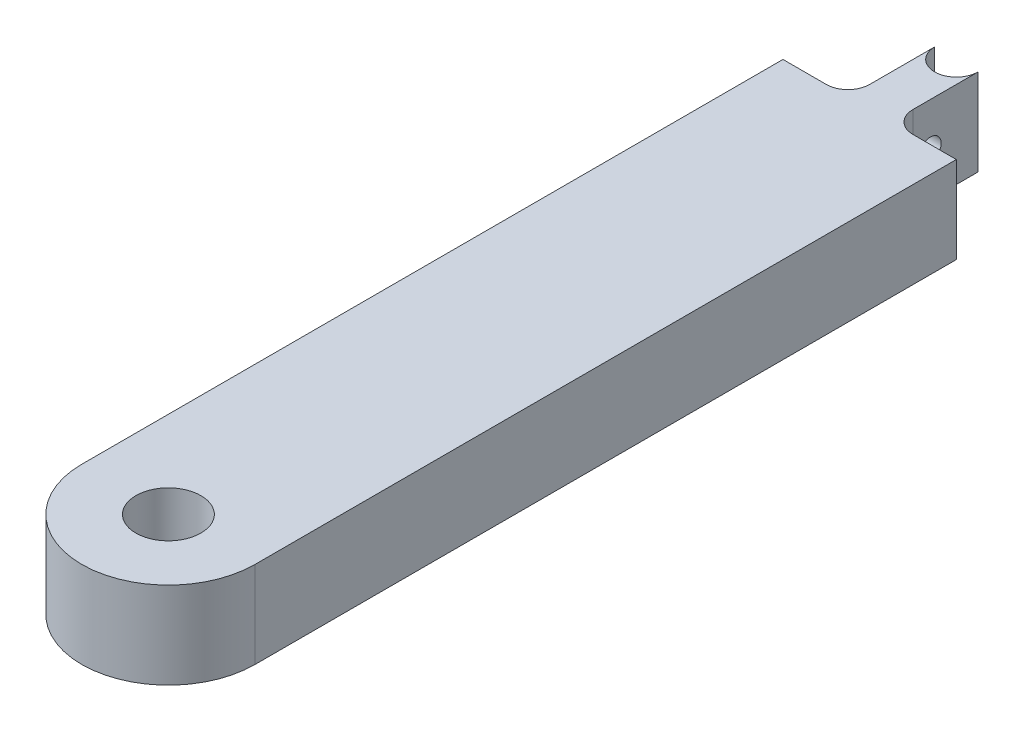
ISO-10303-21;
HEADER;
FILE_DESCRIPTION(('STEP AP214'),'2;1');
FILE_NAME('part.step','',(''),(''),'','','');
FILE_SCHEMA(('AUTOMOTIVE_DESIGN { 1 0 10303 214 1 1 1 1 }'));
ENDSEC;
DATA;
#1=APPLICATION_CONTEXT('core data for automotive mechanical design processes');
#2=APPLICATION_PROTOCOL_DEFINITION('international standard','automotive_design',2000,#1);
#3=PRODUCT_CONTEXT('',#1,'mechanical');
#4=PRODUCT('Part','Part','',(#3));
#5=PRODUCT_RELATED_PRODUCT_CATEGORY('part','',(#4));
#6=PRODUCT_DEFINITION_FORMATION('','',#4);
#7=PRODUCT_DEFINITION_CONTEXT('part definition',#1,'design');
#8=PRODUCT_DEFINITION('design','',#6,#7);
#9=PRODUCT_DEFINITION_SHAPE('','',#8);
#10=(LENGTH_UNIT() NAMED_UNIT(*) SI_UNIT(.MILLI.,.METRE.));
#11=(NAMED_UNIT(*) PLANE_ANGLE_UNIT() SI_UNIT($,.RADIAN.));
#12=(NAMED_UNIT(*) SI_UNIT($,.STERADIAN.) SOLID_ANGLE_UNIT());
#13=UNCERTAINTY_MEASURE_WITH_UNIT(LENGTH_MEASURE(1.E-05),#10,'distance_accuracy_value','');
#14=(GEOMETRIC_REPRESENTATION_CONTEXT(3) GLOBAL_UNCERTAINTY_ASSIGNED_CONTEXT((#13)) GLOBAL_UNIT_ASSIGNED_CONTEXT((#10,
#11,#12)) REPRESENTATION_CONTEXT('',''));
#15=CARTESIAN_POINT('',(0.,0.,0.));
#16=DIRECTION('',(0.,0.,1.));
#17=DIRECTION('',(1.,0.,0.));
#18=AXIS2_PLACEMENT_3D('',#15,#16,#17);
#19=CARTESIAN_POINT('',(6.34999999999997,25.4,0.));
#20=DIRECTION('',(1.,0.,0.));
#21=DIRECTION('',(0.,0.,-1.));
#22=AXIS2_PLACEMENT_3D('',#19,#20,#21);
#23=PLANE('',#22);
#24=CARTESIAN_POINT('',(6.34999999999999,12.699999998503,-216.916));
#25=DIRECTION('',(1.,0.,0.));
#26=DIRECTION('',(0.,0.,-1.));
#27=AXIS2_PLACEMENT_3D('',#24,#25,#26);
#28=CIRCLE('',#27,3.175);
#29=CARTESIAN_POINT('',(6.34999999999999,12.699999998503,-220.091));
#30=VERTEX_POINT('',#29);
#31=EDGE_CURVE('E165',#30,#30,#28,.T.);
#32=ORIENTED_EDGE('',*,*,#31,.F.);
#33=EDGE_LOOP('',(#32));
#34=FACE_BOUND('',#33,.T.);
#35=DIRECTION('',(0.,0.,1.));
#36=VECTOR('',#35,1.);
#37=CARTESIAN_POINT('',(6.34999999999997,25.4,0.));
#38=LINE('',#37,#36);
#39=CARTESIAN_POINT('',(6.35,25.4,-230.886));
#40=VERTEX_POINT('',#39);
#41=CARTESIAN_POINT('',(6.34999999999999,25.4,-211.836));
#42=VERTEX_POINT('',#41);
#43=EDGE_CURVE('E123',#40,#42,#38,.T.);
#44=ORIENTED_EDGE('',*,*,#43,.T.);
#45=DIRECTION('',(0.,-1.,0.));
#46=VECTOR('',#45,1.);
#47=CARTESIAN_POINT('',(6.34999999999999,0.,-211.836));
#48=LINE('',#47,#46);
#49=CARTESIAN_POINT('',(6.34999999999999,0.,-211.836));
#50=VERTEX_POINT('',#49);
#51=EDGE_CURVE('E131',#42,#50,#48,.T.);
#52=ORIENTED_EDGE('',*,*,#51,.T.);
#53=DIRECTION('',(0.,0.,1.));
#54=VECTOR('',#53,1.);
#55=CARTESIAN_POINT('',(6.34999999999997,0.,0.));
#56=LINE('',#55,#54);
#57=CARTESIAN_POINT('',(6.35,0.,-230.886));
#58=VERTEX_POINT('',#57);
#59=EDGE_CURVE('E126',#58,#50,#56,.T.);
#60=ORIENTED_EDGE('',*,*,#59,.F.);
#61=DIRECTION('',(0.,-1.,0.));
#62=VECTOR('',#61,1.);
#63=CARTESIAN_POINT('',(6.35,25.4,-230.886));
#64=LINE('',#63,#62);
#65=EDGE_CURVE('E120',#40,#58,#64,.T.);
#66=ORIENTED_EDGE('',*,*,#65,.F.);
#67=EDGE_LOOP('',(#44,#52,#60,#66));
#68=FACE_BOUND('',#67,.T.);
#69=ADVANCED_FACE('F43',(#34,#68),#23,.T.);
#70=CARTESIAN_POINT('',(0.,25.4,-230.886));
#71=DIRECTION('',(0.,-1.,0.));
#72=DIRECTION('',(0.,0.,-1.));
#73=AXIS2_PLACEMENT_3D('',#70,#71,#72);
#74=CYLINDRICAL_SURFACE('',#73,6.34999999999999);
#75=CARTESIAN_POINT('',(0.,0.,-230.886));
#76=DIRECTION('',(0.,1.,0.));
#77=DIRECTION('',(0.,0.,1.));
#78=AXIS2_PLACEMENT_3D('',#75,#76,#77);
#79=CIRCLE('',#78,6.34999999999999);
#80=CARTESIAN_POINT('',(-6.35,0.,-230.886));
#81=VERTEX_POINT('',#80);
#82=EDGE_CURVE('E164',#81,#58,#79,.T.);
#83=ORIENTED_EDGE('',*,*,#82,.F.);
#84=DIRECTION('',(0.,-1.,0.));
#85=VECTOR('',#84,1.);
#86=CARTESIAN_POINT('',(-6.35,25.4,-230.886));
#87=LINE('',#86,#85);
#88=CARTESIAN_POINT('',(-6.35,25.4,-230.886));
#89=VERTEX_POINT('',#88);
#90=EDGE_CURVE('E132',#89,#81,#87,.T.);
#91=ORIENTED_EDGE('',*,*,#90,.F.);
#92=CARTESIAN_POINT('',(0.,25.4,-230.886));
#93=DIRECTION('',(0.,1.,0.));
#94=DIRECTION('',(0.,0.,1.));
#95=AXIS2_PLACEMENT_3D('',#92,#93,#94);
#96=CIRCLE('',#95,6.34999999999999);
#97=EDGE_CURVE('E137',#89,#40,#96,.T.);
#98=ORIENTED_EDGE('',*,*,#97,.T.);
#99=ORIENTED_EDGE('',*,*,#65,.T.);
#100=EDGE_LOOP('',(#83,#91,#98,#99));
#101=FACE_BOUND('',#100,.T.);
#102=ADVANCED_FACE('F143',(#101),#74,.F.);
#103=CARTESIAN_POINT('',(-6.34999999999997,25.4,0.));
#104=DIRECTION('',(1.,0.,0.));
#105=DIRECTION('',(0.,0.,-1.));
#106=AXIS2_PLACEMENT_3D('',#103,#104,#105);
#107=PLANE('',#106);
#108=CARTESIAN_POINT('',(-6.35000000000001,12.699999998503,-216.916));
#109=DIRECTION('',(-1.,0.,0.));
#110=DIRECTION('',(0.,0.,1.));
#111=AXIS2_PLACEMENT_3D('',#108,#109,#110);
#112=CIRCLE('',#111,3.175);
#113=CARTESIAN_POINT('',(-6.35000000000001,12.699999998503,-213.741));
#114=VERTEX_POINT('',#113);
#115=EDGE_CURVE('E268',#114,#114,#112,.T.);
#116=ORIENTED_EDGE('',*,*,#115,.F.);
#117=EDGE_LOOP('',(#116));
#118=FACE_BOUND('',#117,.T.);
#119=DIRECTION('',(0.,0.,1.));
#120=VECTOR('',#119,1.);
#121=CARTESIAN_POINT('',(-6.34999999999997,0.,0.));
#122=LINE('',#121,#120);
#123=CARTESIAN_POINT('',(-6.34999999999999,0.,-211.836));
#124=VERTEX_POINT('',#123);
#125=EDGE_CURVE('E167',#81,#124,#122,.T.);
#126=ORIENTED_EDGE('',*,*,#125,.T.);
#127=DIRECTION('',(0.,-1.,0.));
#128=VECTOR('',#127,1.);
#129=CARTESIAN_POINT('',(-6.34999999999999,25.4,-211.836));
#130=LINE('',#129,#128);
#131=CARTESIAN_POINT('',(-6.34999999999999,25.4,-211.836));
#132=VERTEX_POINT('',#131);
#133=EDGE_CURVE('E58',#124,#132,#130,.F.);
#134=ORIENTED_EDGE('',*,*,#133,.T.);
#135=DIRECTION('',(0.,0.,1.));
#136=VECTOR('',#135,1.);
#137=CARTESIAN_POINT('',(-6.34999999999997,25.4,0.));
#138=LINE('',#137,#136);
#139=EDGE_CURVE('E144',#89,#132,#138,.T.);
#140=ORIENTED_EDGE('',*,*,#139,.F.);
#141=ORIENTED_EDGE('',*,*,#90,.T.);
#142=EDGE_LOOP('',(#126,#134,#140,#141));
#143=FACE_BOUND('',#142,.T.);
#144=ADVANCED_FACE('F226',(#118,#143),#107,.F.);
#145=CARTESIAN_POINT('',(0.,25.4,-205.486));
#146=DIRECTION('',(0.,0.,1.));
#147=DIRECTION('',(1.,0.,0.));
#148=AXIS2_PLACEMENT_3D('',#145,#146,#147);
#149=PLANE('',#148);
#150=DIRECTION('',(-1.,0.,0.));
#151=VECTOR('',#150,1.);
#152=CARTESIAN_POINT('',(0.,25.4,-205.486));
#153=LINE('',#152,#151);
#154=CARTESIAN_POINT('',(-12.7,25.4,-205.486));
#155=VERTEX_POINT('',#154);
#156=CARTESIAN_POINT('',(-25.4,25.4,-205.486));
#157=VERTEX_POINT('',#156);
#158=EDGE_CURVE('E146',#155,#157,#153,.T.);
#159=ORIENTED_EDGE('',*,*,#158,.F.);
#160=DIRECTION('',(0.,-1.,0.));
#161=VECTOR('',#160,1.);
#162=CARTESIAN_POINT('',(-12.7,0.,-205.486));
#163=LINE('',#162,#161);
#164=CARTESIAN_POINT('',(-12.7,0.,-205.486));
#165=VERTEX_POINT('',#164);
#166=EDGE_CURVE('E195',#155,#165,#163,.T.);
#167=ORIENTED_EDGE('',*,*,#166,.T.);
#168=DIRECTION('',(-1.,0.,0.));
#169=VECTOR('',#168,1.);
#170=CARTESIAN_POINT('',(0.,0.,-205.486));
#171=LINE('',#170,#169);
#172=CARTESIAN_POINT('',(-25.4,0.,-205.486));
#173=VERTEX_POINT('',#172);
#174=EDGE_CURVE('E169',#165,#173,#171,.T.);
#175=ORIENTED_EDGE('',*,*,#174,.T.);
#176=DIRECTION('',(0.,-1.,0.));
#177=VECTOR('',#176,1.);
#178=CARTESIAN_POINT('',(-25.4,25.4,-205.486));
#179=LINE('',#178,#177);
#180=EDGE_CURVE('E188',#157,#173,#179,.T.);
#181=ORIENTED_EDGE('',*,*,#180,.F.);
#182=EDGE_LOOP('',(#159,#167,#175,#181));
#183=FACE_BOUND('',#182,.T.);
#184=ADVANCED_FACE('F231',(#183),#149,.F.);
#185=CARTESIAN_POINT('',(-25.4,25.4,0.));
#186=DIRECTION('',(-1.,0.,0.));
#187=DIRECTION('',(0.,0.,1.));
#188=AXIS2_PLACEMENT_3D('',#185,#186,#187);
#189=PLANE('',#188);
#190=DIRECTION('',(0.,0.,-1.));
#191=VECTOR('',#190,1.);
#192=CARTESIAN_POINT('',(-25.4,0.,0.));
#193=LINE('',#192,#191);
#194=CARTESIAN_POINT('',(-25.4,0.,0.));
#195=VERTEX_POINT('',#194);
#196=EDGE_CURVE('E171',#195,#173,#193,.T.);
#197=ORIENTED_EDGE('',*,*,#196,.F.);
#198=DIRECTION('',(0.,-1.,0.));
#199=VECTOR('',#198,1.);
#200=CARTESIAN_POINT('',(-25.4,25.4,0.));
#201=LINE('',#200,#199);
#202=CARTESIAN_POINT('',(-25.4,25.4,0.));
#203=VERTEX_POINT('',#202);
#204=EDGE_CURVE('E186',#203,#195,#201,.T.);
#205=ORIENTED_EDGE('',*,*,#204,.F.);
#206=DIRECTION('',(0.,0.,-1.));
#207=VECTOR('',#206,1.);
#208=CARTESIAN_POINT('',(-25.4,25.4,0.));
#209=LINE('',#208,#207);
#210=EDGE_CURVE('E151',#203,#157,#209,.T.);
#211=ORIENTED_EDGE('',*,*,#210,.T.);
#212=ORIENTED_EDGE('',*,*,#180,.T.);
#213=EDGE_LOOP('',(#197,#205,#211,#212));
#214=FACE_BOUND('',#213,.T.);
#215=ADVANCED_FACE('F235',(#214),#189,.T.);
#216=CARTESIAN_POINT('',(0.,25.4,0.));
#217=DIRECTION('',(0.,-1.,0.));
#218=DIRECTION('',(0.,0.,-1.));
#219=AXIS2_PLACEMENT_3D('',#216,#217,#218);
#220=CYLINDRICAL_SURFACE('',#219,25.4);
#221=CARTESIAN_POINT('',(0.,0.,0.));
#222=DIRECTION('',(0.,1.,0.));
#223=DIRECTION('',(0.,0.,1.));
#224=AXIS2_PLACEMENT_3D('',#221,#222,#223);
#225=CIRCLE('',#224,25.4);
#226=CARTESIAN_POINT('',(25.4,0.,0.));
#227=VERTEX_POINT('',#226);
#228=EDGE_CURVE('E174',#195,#227,#225,.T.);
#229=ORIENTED_EDGE('',*,*,#228,.T.);
#230=DIRECTION('',(0.,-1.,0.));
#231=VECTOR('',#230,1.);
#232=CARTESIAN_POINT('',(25.4,25.4,0.));
#233=LINE('',#232,#231);
#234=CARTESIAN_POINT('',(25.4,25.4,0.));
#235=VERTEX_POINT('',#234);
#236=EDGE_CURVE('E183',#235,#227,#233,.T.);
#237=ORIENTED_EDGE('',*,*,#236,.F.);
#238=CARTESIAN_POINT('',(0.,25.4,0.));
#239=DIRECTION('',(0.,1.,0.));
#240=DIRECTION('',(0.,0.,1.));
#241=AXIS2_PLACEMENT_3D('',#238,#239,#240);
#242=CIRCLE('',#241,25.4);
#243=EDGE_CURVE('E154',#203,#235,#242,.T.);
#244=ORIENTED_EDGE('',*,*,#243,.F.);
#245=ORIENTED_EDGE('',*,*,#204,.T.);
#246=EDGE_LOOP('',(#229,#237,#244,#245));
#247=FACE_BOUND('',#246,.T.);
#248=ADVANCED_FACE('F239',(#247),#220,.T.);
#249=CARTESIAN_POINT('',(25.4,25.4,0.));
#250=DIRECTION('',(-1.,0.,0.));
#251=DIRECTION('',(0.,0.,1.));
#252=AXIS2_PLACEMENT_3D('',#249,#250,#251);
#253=PLANE('',#252);
#254=DIRECTION('',(0.,0.,-1.));
#255=VECTOR('',#254,1.);
#256=CARTESIAN_POINT('',(25.4,0.,0.));
#257=LINE('',#256,#255);
#258=CARTESIAN_POINT('',(25.4,0.,-205.486));
#259=VERTEX_POINT('',#258);
#260=EDGE_CURVE('E177',#227,#259,#257,.T.);
#261=ORIENTED_EDGE('',*,*,#260,.T.);
#262=DIRECTION('',(0.,-1.,0.));
#263=VECTOR('',#262,1.);
#264=CARTESIAN_POINT('',(25.4,25.4,-205.486));
#265=LINE('',#264,#263);
#266=CARTESIAN_POINT('',(25.4,25.4,-205.486));
#267=VERTEX_POINT('',#266);
#268=EDGE_CURVE('E162',#267,#259,#265,.T.);
#269=ORIENTED_EDGE('',*,*,#268,.F.);
#270=DIRECTION('',(0.,0.,-1.));
#271=VECTOR('',#270,1.);
#272=CARTESIAN_POINT('',(25.4,25.4,0.));
#273=LINE('',#272,#271);
#274=EDGE_CURVE('E157',#235,#267,#273,.T.);
#275=ORIENTED_EDGE('',*,*,#274,.F.);
#276=ORIENTED_EDGE('',*,*,#236,.T.);
#277=EDGE_LOOP('',(#261,#269,#275,#276));
#278=FACE_BOUND('',#277,.T.);
#279=ADVANCED_FACE('F243',(#278),#253,.F.);
#280=CARTESIAN_POINT('',(0.,25.4,-205.486));
#281=DIRECTION('',(0.,0.,-1.));
#282=DIRECTION('',(-1.,0.,0.));
#283=AXIS2_PLACEMENT_3D('',#280,#281,#282);
#284=PLANE('',#283);
#285=DIRECTION('',(1.,0.,0.));
#286=VECTOR('',#285,1.);
#287=CARTESIAN_POINT('',(0.,0.,-205.486));
#288=LINE('',#287,#286);
#289=CARTESIAN_POINT('',(12.7,0.,-205.486));
#290=VERTEX_POINT('',#289);
#291=EDGE_CURVE('E141',#290,#259,#288,.T.);
#292=ORIENTED_EDGE('',*,*,#291,.F.);
#293=DIRECTION('',(0.,-1.,0.));
#294=VECTOR('',#293,1.);
#295=CARTESIAN_POINT('',(12.7,25.4,-205.486));
#296=LINE('',#295,#294);
#297=CARTESIAN_POINT('',(12.7,25.4,-205.486));
#298=VERTEX_POINT('',#297);
#299=EDGE_CURVE('E193',#290,#298,#296,.F.);
#300=ORIENTED_EDGE('',*,*,#299,.T.);
#301=DIRECTION('',(1.,0.,0.));
#302=VECTOR('',#301,1.);
#303=CARTESIAN_POINT('',(0.,25.4,-205.486));
#304=LINE('',#303,#302);
#305=EDGE_CURVE('E160',#298,#267,#304,.T.);
#306=ORIENTED_EDGE('',*,*,#305,.T.);
#307=ORIENTED_EDGE('',*,*,#268,.T.);
#308=EDGE_LOOP('',(#292,#300,#306,#307));
#309=FACE_BOUND('',#308,.T.);
#310=ADVANCED_FACE('F206',(#309),#284,.T.);
#311=CARTESIAN_POINT('',(0.,25.4,0.));
#312=DIRECTION('',(0.,1.,0.));
#313=DIRECTION('',(0.,0.,1.));
#314=AXIS2_PLACEMENT_3D('',#311,#312,#313);
#315=PLANE('',#314);
#316=CARTESIAN_POINT('',(0.,25.4,0.));
#317=DIRECTION('',(0.,1.,0.));
#318=DIRECTION('',(0.,0.,1.));
#319=AXIS2_PLACEMENT_3D('',#316,#317,#318);
#320=CIRCLE('',#319,9.525);
#321=CARTESIAN_POINT('',(0.,25.4,9.525));
#322=VERTEX_POINT('',#321);
#323=EDGE_CURVE('E263',#322,#322,#320,.T.);
#324=ORIENTED_EDGE('',*,*,#323,.F.);
#325=EDGE_LOOP('',(#324));
#326=FACE_BOUND('',#325,.T.);
#327=ORIENTED_EDGE('',*,*,#43,.F.);
#328=ORIENTED_EDGE('',*,*,#97,.F.);
#329=ORIENTED_EDGE('',*,*,#139,.T.);
#330=CARTESIAN_POINT('',(-12.7,25.4,-211.836));
#331=DIRECTION('',(0.,1.,0.));
#332=DIRECTION('',(0.,0.,1.));
#333=AXIS2_PLACEMENT_3D('',#330,#331,#332);
#334=CIRCLE('',#333,6.35);
#335=EDGE_CURVE('E11',#132,#155,#334,.F.);
#336=ORIENTED_EDGE('',*,*,#335,.T.);
#337=ORIENTED_EDGE('',*,*,#158,.T.);
#338=ORIENTED_EDGE('',*,*,#210,.F.);
#339=ORIENTED_EDGE('',*,*,#243,.T.);
#340=ORIENTED_EDGE('',*,*,#274,.T.);
#341=ORIENTED_EDGE('',*,*,#305,.F.);
#342=CARTESIAN_POINT('',(12.7,25.4,-211.836));
#343=DIRECTION('',(0.,1.,0.));
#344=DIRECTION('',(0.,0.,1.));
#345=AXIS2_PLACEMENT_3D('',#342,#343,#344);
#346=CIRCLE('',#345,6.35);
#347=EDGE_CURVE('E140',#298,#42,#346,.F.);
#348=ORIENTED_EDGE('',*,*,#347,.T.);
#349=EDGE_LOOP('',(#327,#328,#329,#336,#337,#338,#339,#340,#341,#348));
#350=FACE_BOUND('',#349,.T.);
#351=ADVANCED_FACE('F136',(#326,#350),#315,.T.);
#352=CARTESIAN_POINT('',(0.,0.,0.));
#353=DIRECTION('',(0.,1.,0.));
#354=DIRECTION('',(0.,0.,1.));
#355=AXIS2_PLACEMENT_3D('',#352,#353,#354);
#356=PLANE('',#355);
#357=CARTESIAN_POINT('',(0.,0.,0.));
#358=DIRECTION('',(0.,-1.,0.));
#359=DIRECTION('',(0.,0.,-1.));
#360=AXIS2_PLACEMENT_3D('',#357,#358,#359);
#361=CIRCLE('',#360,9.525);
#362=CARTESIAN_POINT('',(0.,0.,-9.525));
#363=VERTEX_POINT('',#362);
#364=EDGE_CURVE('E266',#363,#363,#361,.T.);
#365=ORIENTED_EDGE('',*,*,#364,.F.);
#366=EDGE_LOOP('',(#365));
#367=FACE_BOUND('',#366,.T.);
#368=ORIENTED_EDGE('',*,*,#59,.T.);
#369=CARTESIAN_POINT('',(12.7,0.,-211.836));
#370=DIRECTION('',(0.,1.,0.));
#371=DIRECTION('',(0.,0.,1.));
#372=AXIS2_PLACEMENT_3D('',#369,#370,#371);
#373=CIRCLE('',#372,6.35);
#374=EDGE_CURVE('E199',#50,#290,#373,.T.);
#375=ORIENTED_EDGE('',*,*,#374,.T.);
#376=ORIENTED_EDGE('',*,*,#291,.T.);
#377=ORIENTED_EDGE('',*,*,#260,.F.);
#378=ORIENTED_EDGE('',*,*,#228,.F.);
#379=ORIENTED_EDGE('',*,*,#196,.T.);
#380=ORIENTED_EDGE('',*,*,#174,.F.);
#381=CARTESIAN_POINT('',(-12.7,0.,-211.836));
#382=DIRECTION('',(0.,1.,0.));
#383=DIRECTION('',(0.,0.,1.));
#384=AXIS2_PLACEMENT_3D('',#381,#382,#383);
#385=CIRCLE('',#384,6.35);
#386=EDGE_CURVE('E51',#165,#124,#385,.T.);
#387=ORIENTED_EDGE('',*,*,#386,.T.);
#388=ORIENTED_EDGE('',*,*,#125,.F.);
#389=ORIENTED_EDGE('',*,*,#82,.T.);
#390=EDGE_LOOP('',(#368,#375,#376,#377,#378,#379,#380,#387,#388,#389));
#391=FACE_BOUND('',#390,.T.);
#392=ADVANCED_FACE('F202',(#367,#391),#356,.F.);
#393=CARTESIAN_POINT('',(12.7,25.4,-211.836));
#394=DIRECTION('',(0.,1.,0.));
#395=DIRECTION('',(0.,0.,1.));
#396=AXIS2_PLACEMENT_3D('',#393,#394,#395);
#397=CYLINDRICAL_SURFACE('',#396,6.35);
#398=ORIENTED_EDGE('',*,*,#347,.F.);
#399=ORIENTED_EDGE('',*,*,#299,.F.);
#400=ORIENTED_EDGE('',*,*,#374,.F.);
#401=ORIENTED_EDGE('',*,*,#51,.F.);
#402=EDGE_LOOP('',(#398,#399,#400,#401));
#403=FACE_BOUND('',#402,.T.);
#404=ADVANCED_FACE('F208',(#403),#397,.F.);
#405=CARTESIAN_POINT('',(-12.7,25.4,-211.836));
#406=DIRECTION('',(0.,1.,0.));
#407=DIRECTION('',(0.,0.,1.));
#408=AXIS2_PLACEMENT_3D('',#405,#406,#407);
#409=CYLINDRICAL_SURFACE('',#408,6.35);
#410=ORIENTED_EDGE('',*,*,#335,.F.);
#411=ORIENTED_EDGE('',*,*,#133,.F.);
#412=ORIENTED_EDGE('',*,*,#386,.F.);
#413=ORIENTED_EDGE('',*,*,#166,.F.);
#414=EDGE_LOOP('',(#410,#411,#412,#413));
#415=FACE_BOUND('',#414,.T.);
#416=ADVANCED_FACE('F45',(#415),#409,.F.);
#417=CARTESIAN_POINT('',(57.658,12.699999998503,-216.916));
#418=DIRECTION('',(-1.,0.,0.));
#419=DIRECTION('',(0.,0.,1.));
#420=AXIS2_PLACEMENT_3D('',#417,#418,#419);
#421=CYLINDRICAL_SURFACE('',#420,3.175);
#422=ORIENTED_EDGE('',*,*,#31,.T.);
#423=EDGE_LOOP('',(#422));
#424=FACE_BOUND('',#423,.T.);
#425=ORIENTED_EDGE('',*,*,#115,.T.);
#426=EDGE_LOOP('',(#425));
#427=FACE_BOUND('',#426,.T.);
#428=ADVANCED_FACE('F214',(#424,#427),#421,.F.);
#429=CARTESIAN_POINT('',(0.,64.0080000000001,0.));
#430=DIRECTION('',(0.,-1.,0.));
#431=DIRECTION('',(0.,0.,-1.));
#432=AXIS2_PLACEMENT_3D('',#429,#430,#431);
#433=CYLINDRICAL_SURFACE('',#432,9.525);
#434=ORIENTED_EDGE('',*,*,#323,.T.);
#435=EDGE_LOOP('',(#434));
#436=FACE_BOUND('',#435,.T.);
#437=ORIENTED_EDGE('',*,*,#364,.T.);
#438=EDGE_LOOP('',(#437));
#439=FACE_BOUND('',#438,.T.);
#440=ADVANCED_FACE('F254',(#436,#439),#433,.F.);
#441=CLOSED_SHELL('',(#69,#102,#144,#184,#215,#248,#279,#310,#351,#392,#404,#416,#428,#440));
#442=MANIFOLD_SOLID_BREP('B2',#441);
#443=ADVANCED_BREP_SHAPE_REPRESENTATION('',(#18,#442),#14);
#444=SHAPE_DEFINITION_REPRESENTATION(#9,#443);
ENDSEC;
END-ISO-10303-21;
